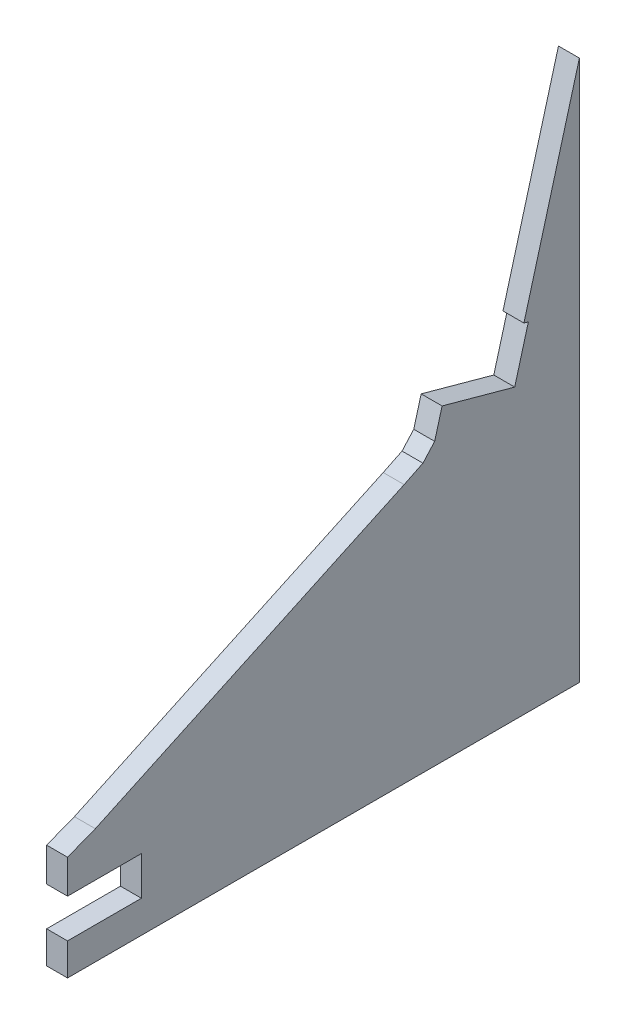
from build123d import *

# Parameters (mm, degrees)
BOSS_EXTRU_1_DEPTH      = 10
ESQUISSE5_R             = 66.434100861
ENL_V_MAT_EXTRU_2_DEPTH = 10


with BuildPart() as part:
    # Esquisse2 → Boss.-Extru.1 (new body)
    with BuildSketch(Plane(origin=(0, 0, 0), x_dir=(0, 0, -1), z_dir=(1, 0, 0))):
        Polygon((28.293245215, -624.646577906), (-119.30983358, -693.286140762), (-132.594000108, -698.435272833), (-132.594000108, -714.571297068), (-97.294000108, -714.571297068), (-97.294000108, -733.071297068), (-132.594000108, -733.071297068), (-132.594000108, -748.435272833), (112.051223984, -748.435272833), (112.051223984, -489.980067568), (85.537201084, -586.401053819), (87.658460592, -586.984361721), (81.136011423, -610.703922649), (46.424456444, -601.158874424), (42.882182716, -614.040719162), (37.284800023, -620.270284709), align=None)
    extrude(amount=BOSS_EXTRU_1_DEPTH)

    # Esquisse5 → Enl_v. mat.-Extru.2 (cut)
    with BuildSketch(Plane.ZY):
        with Locations((-961.779859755, -372.095858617)):
            Circle(ESQUISSE5_R)
    extrude(amount=-ENL_V_MAT_EXTRU_2_DEPTH, mode=Mode.SUBTRACT)


solid = part.part
